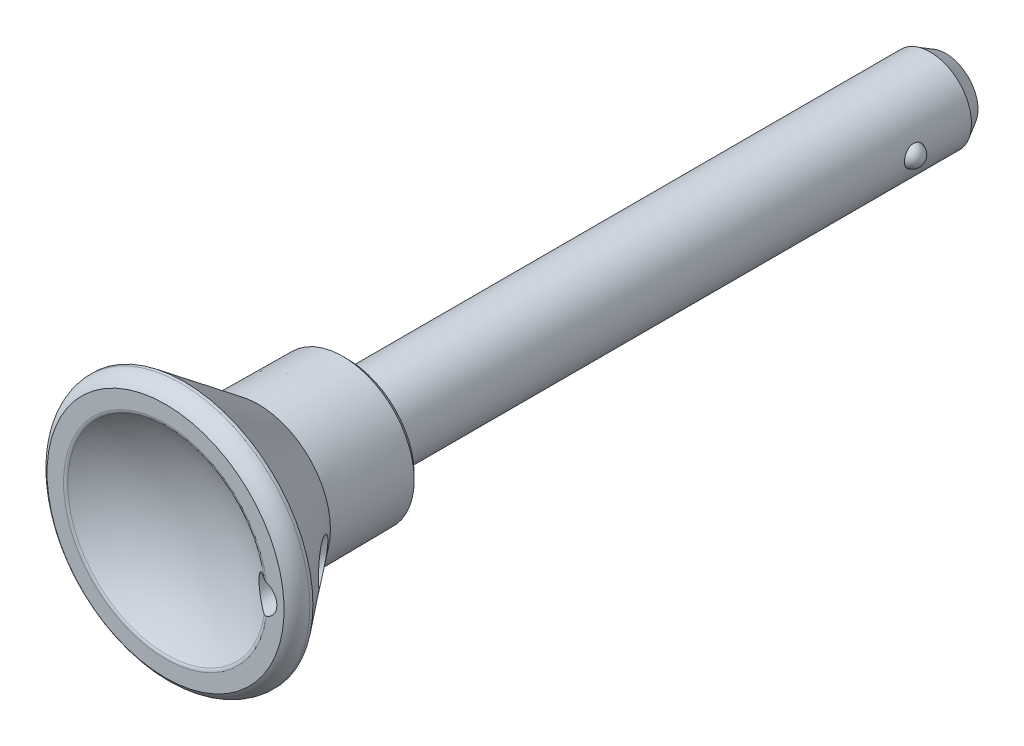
ISO-10303-21;
HEADER;
FILE_DESCRIPTION(('STEP AP214'),'2;1');
FILE_NAME('part.step','',(''),(''),'','','');
FILE_SCHEMA(('AUTOMOTIVE_DESIGN { 1 0 10303 214 1 1 1 1 }'));
ENDSEC;
DATA;
#1=APPLICATION_CONTEXT('core data for automotive mechanical design processes');
#2=APPLICATION_PROTOCOL_DEFINITION('international standard','automotive_design',2000,#1);
#3=PRODUCT_CONTEXT('',#1,'mechanical');
#4=PRODUCT('Part','Part','',(#3));
#5=PRODUCT_RELATED_PRODUCT_CATEGORY('part','',(#4));
#6=PRODUCT_DEFINITION_FORMATION('','',#4);
#7=PRODUCT_DEFINITION_CONTEXT('part definition',#1,'design');
#8=PRODUCT_DEFINITION('design','',#6,#7);
#9=PRODUCT_DEFINITION_SHAPE('','',#8);
#10=(LENGTH_UNIT() NAMED_UNIT(*) SI_UNIT(.MILLI.,.METRE.));
#11=(NAMED_UNIT(*) PLANE_ANGLE_UNIT() SI_UNIT($,.RADIAN.));
#12=(NAMED_UNIT(*) SI_UNIT($,.STERADIAN.) SOLID_ANGLE_UNIT());
#13=UNCERTAINTY_MEASURE_WITH_UNIT(LENGTH_MEASURE(1.E-05),#10,'distance_accuracy_value','');
#14=(GEOMETRIC_REPRESENTATION_CONTEXT(3) GLOBAL_UNCERTAINTY_ASSIGNED_CONTEXT((#13)) GLOBAL_UNIT_ASSIGNED_CONTEXT((#10,
#11,#12)) REPRESENTATION_CONTEXT('',''));
#15=CARTESIAN_POINT('',(0.,0.,0.));
#16=DIRECTION('',(0.,0.,1.));
#17=DIRECTION('',(1.,0.,0.));
#18=AXIS2_PLACEMENT_3D('',#15,#16,#17);
#19=CARTESIAN_POINT('',(0.,0.,0.));
#20=DIRECTION('',(0.,0.,1.));
#21=DIRECTION('',(0.,-1.,0.));
#22=AXIS2_PLACEMENT_3D('',#19,#20,#21);
#23=CYLINDRICAL_SURFACE('',#22,4.);
#24=CARTESIAN_POINT('',(0.,0.,0.));
#25=DIRECTION('',(0.,0.,1.));
#26=DIRECTION('',(0.,-1.,0.));
#27=AXIS2_PLACEMENT_3D('',#24,#25,#26);
#28=CIRCLE('',#27,4.);
#29=CARTESIAN_POINT('',(0.,-4.,0.));
#30=VERTEX_POINT('',#29);
#31=EDGE_CURVE('E17',#30,#30,#28,.T.);
#32=ORIENTED_EDGE('',*,*,#31,.F.);
#33=EDGE_LOOP('',(#32));
#34=FACE_BOUND('',#33,.T.);
#35=CARTESIAN_POINT('',(3.88177455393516,0.96531151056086,-50.7388991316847));
#36=CARTESIAN_POINT('',(3.87947589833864,0.974537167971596,-50.7717537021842));
#37=CARTESIAN_POINT('',(3.87758596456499,0.982015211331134,-50.805105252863));
#38=CARTESIAN_POINT('',(3.87470673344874,0.993322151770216,-50.8719408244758));
#39=CARTESIAN_POINT('',(3.8737042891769,0.997204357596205,-50.9054152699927));
#40=CARTESIAN_POINT('',(3.87228725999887,1.00270077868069,-50.9925132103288));
#41=CARTESIAN_POINT('',(3.87257020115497,1.0016187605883,-51.0463531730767));
#42=CARTESIAN_POINT('',(3.87471439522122,0.993273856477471,-51.1269570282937));
#43=CARTESIAN_POINT('',(3.87573945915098,0.989279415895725,-51.1541316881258));
#44=CARTESIAN_POINT('',(3.87834788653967,0.97900141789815,-51.2080101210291));
#45=CARTESIAN_POINT('',(3.87993110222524,0.972718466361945,-51.2347140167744));
#46=CARTESIAN_POINT('',(3.88177455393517,0.965311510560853,-51.2611008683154));
#47=B_SPLINE_CURVE_WITH_KNOTS('',3,(#35,#36,#37,#38,#39,#40,#41,#42,#43,#44,#45,#46),
.UNSPECIFIED.,.F.,.F.,(4,2,2,2,2,4),(0.,0.102513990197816,0.20348266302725,0.364121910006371,
0.446491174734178,0.528838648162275),.UNSPECIFIED.);
#48=CARTESIAN_POINT('',(3.88177451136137,0.965311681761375,-50.7388997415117));
#49=VERTEX_POINT('',#48);
#50=CARTESIAN_POINT('',(3.88177446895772,0.965311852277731,-51.2610996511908));
#51=VERTEX_POINT('',#50);
#52=EDGE_CURVE('E60',#49,#51,#47,.T.);
#53=ORIENTED_EDGE('',*,*,#52,.T.);
#54=CARTESIAN_POINT('',(3.88177448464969,0.965311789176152,-51.2610998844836));
#55=CARTESIAN_POINT('',(3.88540385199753,0.950638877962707,-51.3155094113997));
#56=CARTESIAN_POINT('',(3.89014046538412,0.931319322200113,-51.3685420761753));
#57=CARTESIAN_POINT('',(3.90112983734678,0.884199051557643,-51.4704413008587));
#58=CARTESIAN_POINT('',(3.90738045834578,0.856410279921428,-51.5193136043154));
#59=CARTESIAN_POINT('',(3.92071189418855,0.793126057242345,-51.6116284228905));
#60=CARTESIAN_POINT('',(3.92779250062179,0.757632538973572,-51.6550722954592));
#61=CARTESIAN_POINT('',(3.94199278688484,0.679892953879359,-51.7354385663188));
#62=CARTESIAN_POINT('',(3.94911247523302,0.637645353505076,-51.7723594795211));
#63=CARTESIAN_POINT('',(3.96270366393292,0.546907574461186,-51.8391103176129));
#64=CARTESIAN_POINT('',(3.96916547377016,0.498343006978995,-51.8688412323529));
#65=CARTESIAN_POINT('',(3.9806028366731,0.396745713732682,-51.9196822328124));
#66=CARTESIAN_POINT('',(3.98557913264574,0.343715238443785,-51.9407966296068));
#67=CARTESIAN_POINT('',(3.99291972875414,0.242471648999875,-51.9713879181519));
#68=CARTESIAN_POINT('',(3.99555479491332,0.194645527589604,-51.9820925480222));
#69=CARTESIAN_POINT('',(3.99909511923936,0.0978826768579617,-51.9963986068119));
#70=CARTESIAN_POINT('',(4.00000061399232,0.0489461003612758,-52.0000010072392));
#71=CARTESIAN_POINT('',(3.99999930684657,-0.0552566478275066,-51.999998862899));
#72=CARTESIAN_POINT('',(3.99884379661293,-0.110525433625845,-51.9954052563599));
#73=CARTESIAN_POINT('',(3.99434700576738,-0.219475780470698,-51.9771816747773));
#74=CARTESIAN_POINT('',(3.9910047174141,-0.273156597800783,-51.9635475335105));
#75=CARTESIAN_POINT('',(3.98250420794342,-0.377347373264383,-51.9277072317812));
#76=CARTESIAN_POINT('',(3.97734807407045,-0.427860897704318,-51.9055109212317));
#77=CARTESIAN_POINT('',(3.96576893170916,-0.524447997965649,-51.8532124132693));
#78=CARTESIAN_POINT('',(3.95934587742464,-0.570521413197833,-51.8231099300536));
#79=CARTESIAN_POINT('',(3.94578204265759,-0.657873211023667,-51.7551953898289));
#80=CARTESIAN_POINT('',(3.93863012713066,-0.699046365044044,-51.7172502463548));
#81=CARTESIAN_POINT('',(3.92448848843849,-0.774509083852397,-51.6350198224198));
#82=CARTESIAN_POINT('',(3.91749874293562,-0.808799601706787,-51.5907354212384));
#83=CARTESIAN_POINT('',(3.90495270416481,-0.867284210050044,-51.5004846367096));
#84=CARTESIAN_POINT('',(3.8993282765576,-0.892041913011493,-51.4548922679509));
#85=CARTESIAN_POINT('',(3.88941506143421,-0.934286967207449,-51.3602904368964));
#86=CARTESIAN_POINT('',(3.88512710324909,-0.951769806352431,-51.3112788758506));
#87=CARTESIAN_POINT('',(3.88177448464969,-0.965311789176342,-51.2610998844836));
#88=B_SPLINE_CURVE_WITH_KNOTS('',3,(#54,#55,#56,#57,#58,#59,#60,#61,#62,#63,#64,#65,#66,#67,#68,
#69,#70,#71,#72,#73,#74,#75,#76,#77,#78,#79,#80,#81,#82,#83,#84,#85,#86,#87),.UNSPECIFIED.,.F.,
.F.,(4,2,2,2,2,2,2,2,2,2,2,2,2,2,2,2,4),(0.,0.169132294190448,0.338027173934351,
0.506879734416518,0.675770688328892,0.846869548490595,1.01788269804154,1.16458276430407,
1.31126276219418,1.47685399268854,1.64252158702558,1.80799916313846,1.97348272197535,
2.14204685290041,2.31058762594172,2.46651284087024,2.62253462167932),.UNSPECIFIED.);
#89=CARTESIAN_POINT('',(3.88177451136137,-0.965311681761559,-51.2611002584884));
#90=VERTEX_POINT('',#89);
#91=EDGE_CURVE('E72',#51,#90,#88,.T.);
#92=ORIENTED_EDGE('',*,*,#91,.T.);
#93=CARTESIAN_POINT('',(3.88177455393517,-0.965311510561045,-51.2611008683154));
#94=CARTESIAN_POINT('',(3.87947589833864,-0.974537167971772,-51.2282462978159));
#95=CARTESIAN_POINT('',(3.87758596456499,-0.982015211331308,-51.1948947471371));
#96=CARTESIAN_POINT('',(3.87470673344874,-0.993322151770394,-51.1280591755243));
#97=CARTESIAN_POINT('',(3.8737042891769,-0.997204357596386,-51.0945847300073));
#98=CARTESIAN_POINT('',(3.87228725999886,-1.00270077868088,-51.0074867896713));
#99=CARTESIAN_POINT('',(3.87257020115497,-1.00161876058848,-50.9536468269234));
#100=CARTESIAN_POINT('',(3.87471439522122,-0.993273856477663,-50.8730429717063));
#101=CARTESIAN_POINT('',(3.87573945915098,-0.989279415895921,-50.8458683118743));
#102=CARTESIAN_POINT('',(3.87834788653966,-0.979001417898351,-50.791989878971));
#103=CARTESIAN_POINT('',(3.87993110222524,-0.972718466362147,-50.7652859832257));
#104=CARTESIAN_POINT('',(3.88177455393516,-0.965311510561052,-50.7388991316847));
#105=B_SPLINE_CURVE_WITH_KNOTS('',3,(#93,#94,#95,#96,#97,#98,#99,#100,#101,#102,#103,#104),
.UNSPECIFIED.,.F.,.F.,(4,2,2,2,2,4),(0.,0.102513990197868,0.203482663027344,0.36412191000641,
0.446491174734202,0.528838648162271),.UNSPECIFIED.);
#106=CARTESIAN_POINT('',(3.88177446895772,-0.965311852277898,-50.7389003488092));
#107=VERTEX_POINT('',#106);
#108=EDGE_CURVE('E57',#90,#107,#105,.T.);
#109=ORIENTED_EDGE('',*,*,#108,.T.);
#110=CARTESIAN_POINT('',(3.88177448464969,-0.965311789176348,-50.7389001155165));
#111=CARTESIAN_POINT('',(3.88540385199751,-0.950638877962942,-50.6844905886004));
#112=CARTESIAN_POINT('',(3.89014046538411,-0.931319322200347,-50.6314579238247));
#113=CARTESIAN_POINT('',(3.90112983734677,-0.884199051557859,-50.5295586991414));
#114=CARTESIAN_POINT('',(3.90738045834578,-0.85641027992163,-50.4806863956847));
#115=CARTESIAN_POINT('',(3.92071189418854,-0.793126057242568,-50.3883715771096));
#116=CARTESIAN_POINT('',(3.92779250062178,-0.75763253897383,-50.3449277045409));
#117=CARTESIAN_POINT('',(3.94199278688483,-0.679892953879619,-50.2645614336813));
#118=CARTESIAN_POINT('',(3.94911247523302,-0.637645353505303,-50.227640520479));
#119=CARTESIAN_POINT('',(3.96270366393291,-0.546907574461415,-50.1608896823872));
#120=CARTESIAN_POINT('',(3.96916547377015,-0.498343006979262,-50.1311587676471));
#121=CARTESIAN_POINT('',(3.98060283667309,-0.396745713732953,-50.0803177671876));
#122=CARTESIAN_POINT('',(3.98557913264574,-0.343715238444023,-50.0592033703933));
#123=CARTESIAN_POINT('',(3.99291972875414,-0.242471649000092,-50.0286120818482));
#124=CARTESIAN_POINT('',(3.99555479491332,-0.194645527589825,-50.0179074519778));
#125=CARTESIAN_POINT('',(3.99909511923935,-0.0978826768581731,-50.0036013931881));
#126=CARTESIAN_POINT('',(4.00000061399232,-0.048946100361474,-49.9999989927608));
#127=CARTESIAN_POINT('',(3.99999930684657,0.0552566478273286,-50.000001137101));
#128=CARTESIAN_POINT('',(3.99884379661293,0.110525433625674,-50.0045947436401));
#129=CARTESIAN_POINT('',(3.99434700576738,0.219475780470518,-50.0228183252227));
#130=CARTESIAN_POINT('',(3.9910047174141,0.273156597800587,-50.0364524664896));
#131=CARTESIAN_POINT('',(3.98250420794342,0.37734737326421,-50.0722927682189));
#132=CARTESIAN_POINT('',(3.97734807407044,0.427860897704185,-50.0944890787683));
#133=CARTESIAN_POINT('',(3.96576893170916,0.52444799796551,-50.1467875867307));
#134=CARTESIAN_POINT('',(3.95934587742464,0.570521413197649,-50.1768900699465));
#135=CARTESIAN_POINT('',(3.94578204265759,0.657873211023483,-50.2448046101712));
#136=CARTESIAN_POINT('',(3.93863012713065,0.699046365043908,-50.2827497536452));
#137=CARTESIAN_POINT('',(3.92448848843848,0.774509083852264,-50.3649801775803));
#138=CARTESIAN_POINT('',(3.91749874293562,0.80879960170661,-50.4092645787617));
#139=CARTESIAN_POINT('',(3.90495270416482,0.867284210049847,-50.4995153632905));
#140=CARTESIAN_POINT('',(3.8993282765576,0.892041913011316,-50.5451077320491));
#141=CARTESIAN_POINT('',(3.8894150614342,0.9342869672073,-50.6397095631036));
#142=CARTESIAN_POINT('',(3.88512710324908,0.951769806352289,-50.6887211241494));
#143=CARTESIAN_POINT('',(3.88177448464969,0.965311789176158,-50.7389001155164));
#144=B_SPLINE_CURVE_WITH_KNOTS('',3,(#110,#111,#112,#113,#114,#115,#116,#117,#118,#119,#120,
#121,#122,#123,#124,#125,#126,#127,#128,#129,#130,#131,#132,#133,#134,#135,#136,#137,#138,#139,
#140,#141,#142,#143),.UNSPECIFIED.,.F.,.F.,(4,2,2,2,2,2,2,2,2,2,2,2,2,2,2,2,4),(0.,
0.169132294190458,0.338027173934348,0.506879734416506,0.675770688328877,0.846869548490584,
1.01788269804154,1.16458276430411,1.31126276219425,1.47685399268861,1.64252158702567,
1.80799916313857,1.97348272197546,2.14204685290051,2.31058762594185,2.46651284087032,
2.62253462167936),.UNSPECIFIED.);
#145=EDGE_CURVE('E66',#107,#49,#144,.T.);
#146=ORIENTED_EDGE('',*,*,#145,.T.);
#147=EDGE_LOOP('',(#53,#92,#109,#146));
#148=FACE_BOUND('',#147,.T.);
#149=CARTESIAN_POINT('',(0.,0.,-56.5));
#150=DIRECTION('',(0.,0.,1.));
#151=DIRECTION('',(1.,0.,0.));
#152=AXIS2_PLACEMENT_3D('',#149,#150,#151);
#153=CIRCLE('',#152,4.);
#154=CARTESIAN_POINT('',(4.,0.,-56.5));
#155=VERTEX_POINT('',#154);
#156=EDGE_CURVE('E69',#155,#155,#153,.T.);
#157=ORIENTED_EDGE('',*,*,#156,.T.);
#158=EDGE_LOOP('',(#157));
#159=FACE_BOUND('',#158,.T.);
#160=ADVANCED_FACE('F14',(#34,#148,#159),#23,.T.);
#161=CARTESIAN_POINT('',(6.4240762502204,-6.50116727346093,0.));
#162=DIRECTION('',(0.,0.,-1.));
#163=DIRECTION('',(-1.,0.,0.));
#164=AXIS2_PLACEMENT_3D('',#161,#162,#163);
#165=PLANE('',#164);
#166=ORIENTED_EDGE('',*,*,#31,.T.);
#167=EDGE_LOOP('',(#166));
#168=FACE_BOUND('',#167,.T.);
#169=CARTESIAN_POINT('',(0.,0.,0.));
#170=DIRECTION('',(0.,0.,1.));
#171=DIRECTION('',(0.,-1.,0.));
#172=AXIS2_PLACEMENT_3D('',#169,#170,#171);
#173=CIRCLE('',#172,6.4240762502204);
#174=CARTESIAN_POINT('',(0.,-6.4240762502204,0.));
#175=VERTEX_POINT('',#174);
#176=EDGE_CURVE('E183',#175,#175,#173,.T.);
#177=ORIENTED_EDGE('',*,*,#176,.F.);
#178=EDGE_LOOP('',(#177));
#179=FACE_BOUND('',#178,.T.);
#180=ADVANCED_FACE('F241',(#168,#179),#165,.T.);
#181=CARTESIAN_POINT('',(0.,0.,0.));
#182=DIRECTION('',(0.,0.,1.));
#183=DIRECTION('',(0.,-1.,0.));
#184=AXIS2_PLACEMENT_3D('',#181,#182,#183);
#185=CONICAL_SURFACE('',#184,6.4240762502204,0.789761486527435);
#186=CARTESIAN_POINT('',(0.,0.,0.499980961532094));
#187=DIRECTION('',(0.,0.,-1.));
#188=DIRECTION('',(1.,0.,0.));
#189=AXIS2_PLACEMENT_3D('',#186,#187,#188);
#190=CIRCLE('',#189,6.92843951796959);
#191=CARTESIAN_POINT('',(6.92843951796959,0.,0.499980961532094));
#192=VERTEX_POINT('',#191);
#193=EDGE_CURVE('E179',#192,#192,#190,.F.);
#194=ORIENTED_EDGE('',*,*,#193,.F.);
#195=EDGE_LOOP('',(#194));
#196=FACE_BOUND('',#195,.T.);
#197=ORIENTED_EDGE('',*,*,#176,.T.);
#198=EDGE_LOOP('',(#197));
#199=FACE_BOUND('',#198,.T.);
#200=ADVANCED_FACE('F233',(#196,#199),#185,.T.);
#201=CARTESIAN_POINT('',(0.,0.,0.499980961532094));
#202=DIRECTION('',(0.,0.,1.));
#203=DIRECTION('',(0.,-1.,0.));
#204=AXIS2_PLACEMENT_3D('',#201,#202,#203);
#205=CONICAL_SURFACE('',#204,6.92843951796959,0.00872664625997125);
#206=CARTESIAN_POINT('',(0.,0.,8.7));
#207=DIRECTION('',(0.,0.,-1.));
#208=DIRECTION('',(1.,0.,0.));
#209=AXIS2_PLACEMENT_3D('',#206,#207,#208);
#210=CIRCLE('',#209,7.);
#211=CARTESIAN_POINT('',(7.,0.,8.7));
#212=VERTEX_POINT('',#211);
#213=EDGE_CURVE('E175',#212,#212,#210,.F.);
#214=ORIENTED_EDGE('',*,*,#213,.F.);
#215=EDGE_LOOP('',(#214));
#216=FACE_BOUND('',#215,.T.);
#217=ORIENTED_EDGE('',*,*,#193,.T.);
#218=EDGE_LOOP('',(#217));
#219=FACE_BOUND('',#218,.T.);
#220=ADVANCED_FACE('F226',(#216,#219),#205,.T.);
#221=CARTESIAN_POINT('',(0.,0.,16.2));
#222=DIRECTION('',(0.,0.,1.));
#223=DIRECTION('',(0.,-1.,0.));
#224=AXIS2_PLACEMENT_3D('',#221,#222,#223);
#225=CYLINDRICAL_SURFACE('',#224,12.5);
#226=CARTESIAN_POINT('',(0.,0.,15.9));
#227=DIRECTION('',(0.,0.,-1.));
#228=DIRECTION('',(1.,0.,0.));
#229=AXIS2_PLACEMENT_3D('',#226,#227,#228);
#230=CIRCLE('',#229,12.5);
#231=CARTESIAN_POINT('',(12.5,0.,15.9));
#232=VERTEX_POINT('',#231);
#233=EDGE_CURVE('E176',#232,#232,#230,.T.);
#234=ORIENTED_EDGE('',*,*,#233,.F.);
#235=EDGE_LOOP('',(#234));
#236=FACE_BOUND('',#235,.T.);
#237=CARTESIAN_POINT('',(0.,0.,16.2));
#238=DIRECTION('',(0.,0.,1.));
#239=DIRECTION('',(0.,-1.,0.));
#240=AXIS2_PLACEMENT_3D('',#237,#238,#239);
#241=CIRCLE('',#240,12.5);
#242=CARTESIAN_POINT('',(0.,-12.5,16.2));
#243=VERTEX_POINT('',#242);
#244=EDGE_CURVE('E172',#243,#243,#241,.T.);
#245=ORIENTED_EDGE('',*,*,#244,.F.);
#246=EDGE_LOOP('',(#245));
#247=FACE_BOUND('',#246,.T.);
#248=ADVANCED_FACE('F219',(#236,#247),#225,.T.);
#249=CARTESIAN_POINT('',(0.,0.,8.7));
#250=DIRECTION('',(0.,0.,1.));
#251=DIRECTION('',(0.,-1.,0.));
#252=AXIS2_PLACEMENT_3D('',#249,#250,#251);
#253=CONICAL_SURFACE('',#252,7.,0.65233090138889);
#254=CARTESIAN_POINT('',(9.05806451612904,-1.48036050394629,11.5515077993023));
#255=CARTESIAN_POINT('',(8.99141512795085,-1.46946825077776,11.4631001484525));
#256=CARTESIAN_POINT('',(8.92550148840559,-1.45408557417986,11.3746905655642));
#257=CARTESIAN_POINT('',(8.7955636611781,-1.41427171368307,11.1984472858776));
#258=CARTESIAN_POINT('',(8.73154031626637,-1.38983655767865,11.1106138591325));
#259=CARTESIAN_POINT('',(8.60623315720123,-1.33170423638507,10.936758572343));
#260=CARTESIAN_POINT('',(8.54493725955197,-1.29805393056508,10.8507298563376));
#261=CARTESIAN_POINT('',(8.42544336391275,-1.22074353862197,10.6811358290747));
#262=CARTESIAN_POINT('',(8.36724184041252,-1.17709515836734,10.5975677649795));
#263=CARTESIAN_POINT('',(8.26922940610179,-1.09114708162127,10.4552980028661));
#264=CARTESIAN_POINT('',(8.22852162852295,-1.05135683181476,10.3957022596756));
#265=CARTESIAN_POINT('',(8.14989980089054,-0.964725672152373,10.2796936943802));
#266=CARTESIAN_POINT('',(8.11198828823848,-0.917878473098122,10.2232837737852));
#267=CARTESIAN_POINT('',(8.03963417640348,-0.81574430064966,10.1148327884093));
#268=CARTESIAN_POINT('',(8.00522654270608,-0.760383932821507,10.0628364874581));
#269=CARTESIAN_POINT('',(7.94192848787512,-0.640477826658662,9.96655825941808));
#270=CARTESIAN_POINT('',(7.91302454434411,-0.575955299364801,9.92225744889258));
#271=CARTESIAN_POINT('',(7.87251252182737,-0.463057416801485,9.85986137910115));
#272=CARTESIAN_POINT('',(7.85846623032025,-0.417573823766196,9.8381417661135));
#273=CARTESIAN_POINT('',(7.83441768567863,-0.323152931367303,9.80086955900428));
#274=CARTESIAN_POINT('',(7.82440740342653,-0.274222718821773,9.78530472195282));
#275=CARTESIAN_POINT('',(7.81132335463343,-0.18762068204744,9.76493500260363));
#276=CARTESIAN_POINT('',(7.80710048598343,-0.15053785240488,9.7583503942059));
#277=CARTESIAN_POINT('',(7.80143783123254,-0.0756412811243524,9.74951765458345));
#278=CARTESIAN_POINT('',(7.79999798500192,-0.0378275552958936,9.7472694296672));
#279=CARTESIAN_POINT('',(7.8000025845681,0.0485200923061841,9.74727695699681));
#280=CARTESIAN_POINT('',(7.80237736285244,0.0970629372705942,9.75098545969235));
#281=CARTESIAN_POINT('',(7.81164444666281,0.192651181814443,9.76543406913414));
#282=CARTESIAN_POINT('',(7.81854204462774,0.239694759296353,9.77618241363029));
#283=CARTESIAN_POINT('',(7.83829683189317,0.341610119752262,9.80688772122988));
#284=CARTESIAN_POINT('',(7.85215507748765,0.395817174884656,9.82838678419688));
#285=CARTESIAN_POINT('',(7.8845198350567,0.499375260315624,9.87838349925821));
#286=CARTESIAN_POINT('',(7.90303499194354,0.548717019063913,9.9068941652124));
#287=CARTESIAN_POINT('',(7.95423062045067,0.667068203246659,9.98533549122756));
#288=CARTESIAN_POINT('',(7.98924354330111,0.732796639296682,10.0386516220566));
#289=CARTESIAN_POINT('',(8.06472209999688,0.853932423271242,10.1525776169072));
#290=CARTESIAN_POINT('',(8.10520064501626,0.909314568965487,10.2132047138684));
#291=CARTESIAN_POINT('',(8.18383548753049,1.00367842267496,10.3298982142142));
#292=CARTESIAN_POINT('',(8.22147534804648,1.04387385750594,10.3853483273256));
#293=CARTESIAN_POINT('',(8.29898008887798,1.1184153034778,10.4986148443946));
#294=CARTESIAN_POINT('',(8.33884646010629,1.15275733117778,10.556432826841));
#295=CARTESIAN_POINT('',(8.42042546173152,1.21614962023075,10.6737908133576));
#296=CARTESIAN_POINT('',(8.46214099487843,1.24519116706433,10.7333334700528));
#297=CARTESIAN_POINT('',(8.54706483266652,1.29830522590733,10.8535675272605));
#298=CARTESIAN_POINT('',(8.59027353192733,1.32237641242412,10.9142592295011));
#299=CARTESIAN_POINT('',(8.69675324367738,1.37513054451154,11.0626135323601));
#300=CARTESIAN_POINT('',(8.7606819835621,1.40136483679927,11.150681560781));
#301=CARTESIAN_POINT('',(8.89058399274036,1.44466814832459,11.3275915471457));
#302=CARTESIAN_POINT('',(8.95655819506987,1.46173291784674,11.4164338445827));
#303=CARTESIAN_POINT('',(9.09008194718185,1.48679092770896,11.5942301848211));
#304=CARTESIAN_POINT('',(9.15763151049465,1.49478409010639,11.683184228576));
#305=CARTESIAN_POINT('',(9.293788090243,1.50153429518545,11.8605390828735));
#306=CARTESIAN_POINT('',(9.36239469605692,1.50029483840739,11.9489400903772));
#307=CARTESIAN_POINT('',(9.53896432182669,1.48478544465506,12.1740527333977));
#308=CARTESIAN_POINT('',(9.64741582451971,1.46359594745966,12.3100469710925));
#309=CARTESIAN_POINT('',(9.80896256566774,1.41213790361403,12.5095339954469));
#310=CARTESIAN_POINT('',(9.86259038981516,1.39172486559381,12.5752398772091));
#311=CARTESIAN_POINT('',(9.96902195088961,1.34380635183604,12.7046889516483));
#312=CARTESIAN_POINT('',(10.021826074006,1.31630431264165,12.7684330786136));
#313=CARTESIAN_POINT('',(10.1398540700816,1.24522266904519,12.9099256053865));
#314=CARTESIAN_POINT('',(10.2046458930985,1.1993124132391,12.9868895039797));
#315=CARTESIAN_POINT('',(10.3299573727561,1.09357010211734,13.1345591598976));
#316=CARTESIAN_POINT('',(10.3904821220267,1.03375502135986,13.2052724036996));
#317=CARTESIAN_POINT('',(10.4895745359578,0.916081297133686,13.3202576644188));
#318=CARTESIAN_POINT('',(10.5297805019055,0.861692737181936,13.3666468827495));
#319=CARTESIAN_POINT('',(10.6043536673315,0.743973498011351,13.452316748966));
#320=CARTESIAN_POINT('',(10.6387288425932,0.68065525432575,13.4916071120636));
#321=CARTESIAN_POINT('',(10.6925693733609,0.560424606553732,13.5529446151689));
#322=CARTESIAN_POINT('',(10.7136506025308,0.505208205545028,13.5768833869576));
#323=CARTESIAN_POINT('',(10.7495749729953,0.390302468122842,13.6176027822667));
#324=CARTESIAN_POINT('',(10.7644289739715,0.330621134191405,13.6343958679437));
#325=CARTESIAN_POINT('',(10.7836092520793,0.22559659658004,13.6560593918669));
#326=CARTESIAN_POINT('',(10.7897268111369,0.180990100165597,13.6629607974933));
#327=CARTESIAN_POINT('',(10.7979243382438,0.0909301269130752,13.6722061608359));
#328=CARTESIAN_POINT('',(10.8000037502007,0.0454765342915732,13.6745494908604));
#329=CARTESIAN_POINT('',(10.799994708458,-0.0641674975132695,13.6745397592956));
#330=CARTESIAN_POINT('',(10.795841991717,-0.128380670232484,13.6698606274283));
#331=CARTESIAN_POINT('',(10.7796239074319,-0.254506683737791,13.6515601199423));
#332=CARTESIAN_POINT('',(10.7675483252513,-0.316416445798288,13.6379272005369));
#333=CARTESIAN_POINT('',(10.7366563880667,-0.435644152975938,13.6029693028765));
#334=CARTESIAN_POINT('',(10.7178919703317,-0.49299342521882,13.5817035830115));
#335=CARTESIAN_POINT('',(10.6748799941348,-0.602645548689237,13.532811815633));
#336=CARTESIAN_POINT('',(10.6506301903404,-0.654946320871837,13.5051831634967));
#337=CARTESIAN_POINT('',(10.5859735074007,-0.77647271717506,13.4312530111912));
#338=CARTESIAN_POINT('',(10.5432056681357,-0.842728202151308,13.3821425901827));
#339=CARTESIAN_POINT('',(10.4516580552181,-0.964099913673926,13.2763616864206));
#340=CARTESIAN_POINT('',(10.4028645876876,-1.01918998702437,13.2196739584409));
#341=CARTESIAN_POINT('',(10.2766029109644,-1.14345503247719,13.0719673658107));
#342=CARTESIAN_POINT('',(10.1967753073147,-1.20635475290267,12.9777102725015));
#343=CARTESIAN_POINT('',(10.0329696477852,-1.31236147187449,12.7820645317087));
#344=CARTESIAN_POINT('',(9.94898466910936,-1.35543413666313,12.6806638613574));
#345=CARTESIAN_POINT('',(9.79718248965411,-1.41705079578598,12.4951419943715));
#346=CARTESIAN_POINT('',(9.72964852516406,-1.43883766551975,12.4118303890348));
#347=CARTESIAN_POINT('',(9.59439459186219,-1.47247845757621,12.2433068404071));
#348=CARTESIAN_POINT('',(9.52667453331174,-1.48432617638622,12.1580937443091));
#349=CARTESIAN_POINT('',(9.39151350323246,-1.49875216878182,11.9862568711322));
#350=CARTESIAN_POINT('',(9.32407407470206,-1.50130123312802,11.8996295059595));
#351=CARTESIAN_POINT('',(9.19020636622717,-1.49747387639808,11.725837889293));
#352=CARTESIAN_POINT('',(9.12377782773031,-1.49109977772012,11.6386737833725));
#353=CARTESIAN_POINT('',(9.05806451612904,-1.48036050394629,11.5515077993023));
#354=B_SPLINE_CURVE_WITH_KNOTS('',3,(#254,#255,#256,#257,#258,#259,#260,#261,#262,#263,#264,
#265,#266,#267,#268,#269,#270,#271,#272,#273,#274,#275,#276,#277,#278,#279,#280,#281,#282,#283,
#284,#285,#286,#287,#288,#289,#290,#291,#292,#293,#294,#295,#296,#297,#298,#299,#300,#301,#302,
#303,#304,#305,#306,#307,#308,#309,#310,#311,#312,#313,#314,#315,#316,#317,#318,#319,#320,#321,
#322,#323,#324,#325,#326,#327,#328,#329,#330,#331,#332,#333,#334,#335,#336,#337,#338,#339,#340,
#341,#342,#343,#344,#345,#346,#347,#348,#349,#350,#351,#352,#353),.UNSPECIFIED.,.T.,.F.,(4,2,2,
2,2,2,2,2,2,2,2,2,2,2,2,2,2,2,2,2,2,2,2,2,2,2,2,2,2,2,2,2,2,2,2,2,2,2,2,2,2,2,2,2,2,2,2,2,2,4),
(0.,0.333658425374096,0.667463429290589,0.999601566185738,1.33135280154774,1.57826788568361,
1.82540433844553,2.07480511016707,2.32358497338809,2.48005639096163,2.63621497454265,
2.74958301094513,2.86294859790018,3.00835870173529,3.15393926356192,3.33275537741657,
3.51190592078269,3.78514778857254,4.05904679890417,4.2931693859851,4.52745067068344,
4.76211373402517,4.9968392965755,5.33221840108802,5.66775280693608,6.00329009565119,
6.33870017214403,6.86226215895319,7.12372139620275,7.38505412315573,7.71589293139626,
8.04632996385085,8.29159071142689,8.53651321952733,8.72709088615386,8.91733480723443,
9.05359735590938,9.18987866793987,9.38217192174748,9.57471358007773,9.76579164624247,
9.95694806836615,10.2340958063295,10.5118854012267,10.9254412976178,11.3397106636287,
11.6675345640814,11.995562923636,12.3246208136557,12.6535930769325),.UNSPECIFIED.);
#355=CARTESIAN_POINT('',(9.05806451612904,-1.48036050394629,11.5515077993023));
#356=VERTEX_POINT('',#355);
#357=EDGE_CURVE('E142',#356,#356,#354,.T.);
#358=ORIENTED_EDGE('',*,*,#357,.F.);
#359=EDGE_LOOP('',(#358));
#360=FACE_BOUND('',#359,.T.);
#361=ORIENTED_EDGE('',*,*,#233,.T.);
#362=EDGE_LOOP('',(#361));
#363=FACE_BOUND('',#362,.T.);
#364=ORIENTED_EDGE('',*,*,#213,.T.);
#365=EDGE_LOOP('',(#364));
#366=FACE_BOUND('',#365,.T.);
#367=ADVANCED_FACE('F165',(#360,#363,#366),#253,.T.);
#368=CARTESIAN_POINT('',(0.,0.,15.9596620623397));
#369=DIRECTION('',(0.,0.,1.));
#370=DIRECTION('',(0.,-1.,0.));
#371=AXIS2_PLACEMENT_3D('',#368,#369,#370);
#372=TOROIDAL_SURFACE('',#371,10.5144930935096,2.);
#373=ORIENTED_EDGE('',*,*,#244,.T.);
#374=EDGE_LOOP('',(#373));
#375=FACE_BOUND('',#374,.T.);
#376=CARTESIAN_POINT('',(0.,0.,17.7));
#377=DIRECTION('',(0.,0.,1.));
#378=DIRECTION('',(0.,-1.,0.));
#379=AXIS2_PLACEMENT_3D('',#376,#377,#378);
#380=CIRCLE('',#379,11.5);
#381=CARTESIAN_POINT('',(0.,-11.5,17.7));
#382=VERTEX_POINT('',#381);
#383=EDGE_CURVE('E187',#382,#382,#380,.T.);
#384=ORIENTED_EDGE('',*,*,#383,.F.);
#385=EDGE_LOOP('',(#384));
#386=FACE_BOUND('',#385,.T.);
#387=ADVANCED_FACE('F157',(#375,#386),#372,.T.);
#388=CARTESIAN_POINT('',(9.3,0.,9.7468824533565));
#389=DIRECTION('',(0.,0.,1.));
#390=DIRECTION('',(0.,-1.,0.));
#391=AXIS2_PLACEMENT_3D('',#388,#389,#390);
#392=CYLINDRICAL_SURFACE('',#391,1.5);
#393=ORIENTED_EDGE('',*,*,#357,.T.);
#394=EDGE_LOOP('',(#393));
#395=FACE_BOUND('',#394,.T.);
#396=CARTESIAN_POINT('',(9.79838709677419,-1.41478277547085,17.7));
#397=CARTESIAN_POINT('',(9.76967463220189,-1.42493393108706,17.7000278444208));
#398=CARTESIAN_POINT('',(9.74057958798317,-1.43416331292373,17.6978154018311));
#399=CARTESIAN_POINT('',(9.68339626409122,-1.45046247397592,17.688811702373));
#400=CARTESIAN_POINT('',(9.65530246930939,-1.45758512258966,17.6821493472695));
#401=CARTESIAN_POINT('',(9.60265119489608,-1.46937623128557,17.6649718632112));
#402=CARTESIAN_POINT('',(9.5780018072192,-1.47420693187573,17.6548534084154));
#403=CARTESIAN_POINT('',(9.52973678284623,-1.48251466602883,17.6305344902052));
#404=CARTESIAN_POINT('',(9.50616459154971,-1.48595330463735,17.6162348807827));
#405=CARTESIAN_POINT('',(9.48387096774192,-1.48868783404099,17.6));
#406=B_SPLINE_CURVE_WITH_KNOTS('',3,(#396,#397,#398,#399,#400,#401,#402,#403,#404,#405),
.UNSPECIFIED.,.F.,.F.,(4,2,2,2,4),(0.,0.0913475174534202,0.180157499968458,0.261045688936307,
0.344033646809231),.UNSPECIFIED.);
#407=CARTESIAN_POINT('',(9.79838709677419,-1.41478277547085,17.7));
#408=VERTEX_POINT('',#407);
#409=CARTESIAN_POINT('',(9.48387096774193,-1.48868783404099,17.6));
#410=VERTEX_POINT('',#409);
#411=EDGE_CURVE('E134',#408,#410,#406,.T.);
#412=ORIENTED_EDGE('',*,*,#411,.F.);
#413=CARTESIAN_POINT('',(9.3,0.,17.7));
#414=DIRECTION('',(0.,0.,1.));
#415=DIRECTION('',(0.,-1.,0.));
#416=AXIS2_PLACEMENT_3D('',#413,#414,#415);
#417=CIRCLE('',#416,1.5);
#418=CARTESIAN_POINT('',(9.79838709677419,1.41478277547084,17.7));
#419=VERTEX_POINT('',#418);
#420=EDGE_CURVE('E30',#419,#408,#417,.F.);
#421=ORIENTED_EDGE('',*,*,#420,.F.);
#422=CARTESIAN_POINT('',(9.79838709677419,1.41478277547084,17.7));
#423=CARTESIAN_POINT('',(9.76967463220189,1.42493393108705,17.7000278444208));
#424=CARTESIAN_POINT('',(9.74057958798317,1.43416331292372,17.6978154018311));
#425=CARTESIAN_POINT('',(9.68339626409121,1.45046247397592,17.688811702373));
#426=CARTESIAN_POINT('',(9.65530246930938,1.45758512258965,17.6821493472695));
#427=CARTESIAN_POINT('',(9.60265119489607,1.46937623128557,17.6649718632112));
#428=CARTESIAN_POINT('',(9.57800180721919,1.47420693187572,17.6548534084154));
#429=CARTESIAN_POINT('',(9.52973678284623,1.48251466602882,17.6305344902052));
#430=CARTESIAN_POINT('',(9.50616459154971,1.48595330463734,17.6162348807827));
#431=CARTESIAN_POINT('',(9.48387096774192,1.48868783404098,17.6));
#432=B_SPLINE_CURVE_WITH_KNOTS('',3,(#422,#423,#424,#425,#426,#427,#428,#429,#430,#431),
.UNSPECIFIED.,.F.,.F.,(4,2,2,2,4),(0.,0.0913475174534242,0.180157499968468,0.261045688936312,
0.344033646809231),.UNSPECIFIED.);
#433=CARTESIAN_POINT('',(9.48387096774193,1.48868783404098,17.6));
#434=VERTEX_POINT('',#433);
#435=EDGE_CURVE('E126',#419,#434,#432,.T.);
#436=ORIENTED_EDGE('',*,*,#435,.T.);
#437=CARTESIAN_POINT('',(9.48387096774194,-1.48868783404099,17.6));
#438=CARTESIAN_POINT('',(9.38181447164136,-1.5012604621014,17.5258231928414));
#439=CARTESIAN_POINT('',(9.27847034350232,-1.50339409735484,17.4514075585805));
#440=CARTESIAN_POINT('',(9.07150168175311,-1.48616897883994,17.3036113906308));
#441=CARTESIAN_POINT('',(8.96788247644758,-1.46662385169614,17.230245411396));
#442=CARTESIAN_POINT('',(8.76570217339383,-1.40554015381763,17.0882393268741));
#443=CARTESIAN_POINT('',(8.66709675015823,-1.36425592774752,17.0195547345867));
#444=CARTESIAN_POINT('',(8.47807170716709,-1.25938003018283,16.8888158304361));
#445=CARTESIAN_POINT('',(8.38761877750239,-1.19588484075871,16.8267343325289));
#446=CARTESIAN_POINT('',(8.24568836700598,-1.0697955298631,16.7298945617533));
#447=CARTESIAN_POINT('',(8.19079097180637,-1.01295594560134,16.692612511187));
#448=CARTESIAN_POINT('',(8.08925811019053,-0.889102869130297,16.6238983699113));
#449=CARTESIAN_POINT('',(8.04262373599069,-0.822088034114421,16.5924670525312));
#450=CARTESIAN_POINT('',(7.95961243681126,-0.678453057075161,16.5366671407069));
#451=CARTESIAN_POINT('',(7.9233211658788,-0.601759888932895,16.5123574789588));
#452=CARTESIAN_POINT('',(7.86387797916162,-0.441385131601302,16.4726071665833));
#453=CARTESIAN_POINT('',(7.84069382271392,-0.357721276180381,16.4571447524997));
#454=CARTESIAN_POINT('',(7.81665644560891,-0.227526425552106,16.4411240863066));
#455=CARTESIAN_POINT('',(7.81042627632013,-0.182354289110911,16.4369745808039));
#456=CARTESIAN_POINT('',(7.80209606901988,-0.0914654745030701,16.4314273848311));
#457=CARTESIAN_POINT('',(7.79999581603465,-0.0457488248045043,16.4300295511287));
#458=CARTESIAN_POINT('',(7.8000067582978,0.0738974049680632,16.4300365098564));
#459=CARTESIAN_POINT('',(7.80550430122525,0.147878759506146,16.4336949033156));
#460=CARTESIAN_POINT('',(7.82172596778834,0.257047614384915,16.4445026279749));
#461=CARTESIAN_POINT('',(7.82847272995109,0.293170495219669,16.4489987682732));
#462=CARTESIAN_POINT('',(7.84452794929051,0.36460984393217,16.4597055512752));
#463=CARTESIAN_POINT('',(7.85383787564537,0.399925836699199,16.4659171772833));
#464=CARTESIAN_POINT('',(7.88533418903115,0.503926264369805,16.4869492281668));
#465=CARTESIAN_POINT('',(7.91114789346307,0.571060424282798,16.5042071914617));
#466=CARTESIAN_POINT('',(7.97122958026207,0.699580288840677,16.5444764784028));
#467=CARTESIAN_POINT('',(8.00550445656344,0.760961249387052,16.5674924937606));
#468=CARTESIAN_POINT('',(8.06330229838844,0.849663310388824,16.6064232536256));
#469=CARTESIAN_POINT('',(8.08431449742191,0.879441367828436,16.6205962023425));
#470=CARTESIAN_POINT('',(8.12808579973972,0.936974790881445,16.6501700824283));
#471=CARTESIAN_POINT('',(8.15084283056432,0.964732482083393,16.6655695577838));
#472=CARTESIAN_POINT('',(8.22150377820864,1.04495101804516,16.7134720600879));
#473=CARTESIAN_POINT('',(8.27178709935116,1.09434151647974,16.7476721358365));
#474=CARTESIAN_POINT('',(8.38550726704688,1.19170689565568,16.8253434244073));
#475=CARTESIAN_POINT('',(8.44976642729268,1.2382209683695,16.8694253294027));
#476=CARTESIAN_POINT('',(8.58287694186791,1.31978473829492,16.961227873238));
#477=CARTESIAN_POINT('',(8.65173257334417,1.3548235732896,17.0089519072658));
#478=CARTESIAN_POINT('',(8.76337185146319,1.40144242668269,17.0867690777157));
#479=CARTESIAN_POINT('',(8.80522580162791,1.41674274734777,17.1160369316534));
#480=CARTESIAN_POINT('',(8.88962205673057,1.44344948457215,17.1752539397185));
#481=CARTESIAN_POINT('',(8.93216367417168,1.45485956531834,17.2052024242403));
#482=CARTESIAN_POINT('',(9.06048356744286,1.48334429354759,17.2958544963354));
#483=CARTESIAN_POINT('',(9.14699642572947,1.4946896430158,17.3573922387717));
#484=CARTESIAN_POINT('',(9.31725275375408,1.50223877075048,17.4793658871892));
#485=CARTESIAN_POINT('',(9.40099551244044,1.49891929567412,17.5397732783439));
#486=CARTESIAN_POINT('',(9.48387096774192,1.4886878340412,17.6));
#487=B_SPLINE_CURVE_WITH_KNOTS('',3,(#437,#438,#439,#440,#441,#442,#443,#444,#445,#446,#447,
#448,#449,#450,#451,#452,#453,#454,#455,#456,#457,#458,#459,#460,#461,#462,#463,#464,#465,#466,
#467,#468,#469,#470,#471,#472,#473,#474,#475,#476,#477,#478,#479,#480,#481,#482,#483,#484,#485,
#486),.UNSPECIFIED.,.F.,.F.,(4,2,2,2,2,2,2,2,2,2,2,2,2,2,2,2,2,2,2,2,2,2,2,2,4),(0.,
0.380173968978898,0.763641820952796,1.14271969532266,1.52017093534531,1.7812816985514,
2.04242694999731,2.30567583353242,2.5682743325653,2.70539664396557,2.84251181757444,
3.06399194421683,3.17494513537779,3.2859620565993,3.50680011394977,3.72781870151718,
3.8450322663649,3.96210870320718,4.19632161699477,4.4675973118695,4.73912905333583,
4.89893578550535,5.05859157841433,5.37775215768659,5.6866146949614),.UNSPECIFIED.);
#488=EDGE_CURVE('E141',#410,#434,#487,.T.);
#489=ORIENTED_EDGE('',*,*,#488,.F.);
#490=EDGE_LOOP('',(#412,#421,#436,#489));
#491=FACE_BOUND('',#490,.T.);
#492=ADVANCED_FACE('F152',(#395,#491),#392,.F.);
#493=CARTESIAN_POINT('',(0.,0.,30.4));
#494=DIRECTION('',(0.,-1.,0.));
#495=DIRECTION('',(0.,0.,1.));
#496=AXIS2_PLACEMENT_3D('',#493,#494,#495);
#497=SPHERICAL_SURFACE('',#496,16.);
#498=ORIENTED_EDGE('',*,*,#488,.T.);
#499=CARTESIAN_POINT('',(0.,0.,17.6));
#500=DIRECTION('',(0.,0.,1.));
#501=DIRECTION('',(0.,-1.,0.));
#502=AXIS2_PLACEMENT_3D('',#499,#500,#501);
#503=CIRCLE('',#502,9.6);
#504=EDGE_CURVE('E23',#410,#434,#503,.F.);
#505=ORIENTED_EDGE('',*,*,#504,.F.);
#506=EDGE_LOOP('',(#498,#505));
#507=FACE_BOUND('',#506,.T.);
#508=ADVANCED_FACE('F156',(#507),#497,.F.);
#509=CARTESIAN_POINT('',(-11.73,-11.4999999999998,17.7));
#510=CARTESIAN_POINT('',(-11.5,-11.4999999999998,17.7));
#511=CARTESIAN_POINT('',(11.5,-11.4999999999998,17.7));
#512=B_SPLINE_CURVE_WITH_KNOTS('',1,(#509,#510,#511),.UNSPECIFIED.,.F.,.F.,(2,1,2),(-0.01,0.,
1.),.UNSPECIFIED.);
#513=DIRECTION('',(0.,1.,0.));
#514=VECTOR('',#513,1.);
#515=SURFACE_OF_LINEAR_EXTRUSION('',#512,#514);
#516=ORIENTED_EDGE('',*,*,#420,.T.);
#517=CARTESIAN_POINT('',(0.,0.,17.7));
#518=DIRECTION('',(0.,0.,1.));
#519=DIRECTION('',(0.,-1.,0.));
#520=AXIS2_PLACEMENT_3D('',#517,#518,#519);
#521=CIRCLE('',#520,9.9);
#522=EDGE_CURVE('E9',#419,#408,#521,.T.);
#523=ORIENTED_EDGE('',*,*,#522,.F.);
#524=EDGE_LOOP('',(#516,#523));
#525=FACE_BOUND('',#524,.T.);
#526=ORIENTED_EDGE('',*,*,#383,.T.);
#527=EDGE_LOOP('',(#526));
#528=FACE_BOUND('',#527,.T.);
#529=ADVANCED_FACE('F121',(#525,#528),#515,.T.);
#530=CARTESIAN_POINT('',(0.,0.,17.2));
#531=DIRECTION('',(0.,0.,1.));
#532=DIRECTION('',(0.,-1.,0.));
#533=AXIS2_PLACEMENT_3D('',#530,#531,#532);
#534=TOROIDAL_SURFACE('',#533,9.89999999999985,0.50000000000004);
#535=ORIENTED_EDGE('',*,*,#435,.F.);
#536=ORIENTED_EDGE('',*,*,#522,.T.);
#537=ORIENTED_EDGE('',*,*,#411,.T.);
#538=ORIENTED_EDGE('',*,*,#504,.T.);
#539=EDGE_LOOP('',(#535,#536,#537,#538));
#540=FACE_BOUND('',#539,.T.);
#541=ADVANCED_FACE('F115',(#540),#534,.T.);
#542=CARTESIAN_POINT('',(3.13397459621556,-3.17158441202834,-58.));
#543=DIRECTION('',(0.,0.,-1.));
#544=DIRECTION('',(-1.,0.,0.));
#545=AXIS2_PLACEMENT_3D('',#542,#543,#544);
#546=PLANE('',#545);
#547=CARTESIAN_POINT('',(0.,0.,-58.));
#548=DIRECTION('',(0.,0.,1.));
#549=DIRECTION('',(0.,-1.,0.));
#550=AXIS2_PLACEMENT_3D('',#547,#548,#549);
#551=CIRCLE('',#550,3.13397459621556);
#552=CARTESIAN_POINT('',(0.,-3.13397459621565,-58.));
#553=VERTEX_POINT('',#552);
#554=EDGE_CURVE('E63',#553,#553,#551,.T.);
#555=ORIENTED_EDGE('',*,*,#554,.F.);
#556=EDGE_LOOP('',(#555));
#557=FACE_BOUND('',#556,.T.);
#558=ADVANCED_FACE('F120',(#557),#546,.T.);
#559=CARTESIAN_POINT('',(0.,0.,-58.));
#560=DIRECTION('',(0.,0.,1.));
#561=DIRECTION('',(0.,-1.,0.));
#562=AXIS2_PLACEMENT_3D('',#559,#560,#561);
#563=CONICAL_SURFACE('',#562,3.13397459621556,0.523598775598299);
#564=ORIENTED_EDGE('',*,*,#156,.F.);
#565=EDGE_LOOP('',(#564));
#566=FACE_BOUND('',#565,.T.);
#567=ORIENTED_EDGE('',*,*,#554,.T.);
#568=EDGE_LOOP('',(#567));
#569=FACE_BOUND('',#568,.T.);
#570=ADVANCED_FACE('F96',(#566,#569),#563,.T.);
#571=CARTESIAN_POINT('',(3.88177446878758,0.,-51.));
#572=DIRECTION('',(1.,0.,0.));
#573=DIRECTION('',(0.,-1.,0.));
#574=AXIS2_PLACEMENT_3D('',#571,#572,#573);
#575=CYLINDRICAL_SURFACE('',#574,1.);
#576=ORIENTED_EDGE('',*,*,#145,.F.);
#577=CARTESIAN_POINT('',(3.88177446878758,0.,-51.));
#578=DIRECTION('',(1.,0.,0.));
#579=DIRECTION('',(0.,-1.,0.));
#580=AXIS2_PLACEMENT_3D('',#577,#578,#579);
#581=CIRCLE('',#580,1.);
#582=EDGE_CURVE('E52',#107,#49,#581,.F.);
#583=ORIENTED_EDGE('',*,*,#582,.T.);
#584=EDGE_LOOP('',(#576,#583));
#585=FACE_BOUND('',#584,.T.);
#586=ADVANCED_FACE('F67',(#585),#575,.F.);
#587=CARTESIAN_POINT('',(3.88177446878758,0.,-51.));
#588=DIRECTION('',(1.,0.,0.));
#589=DIRECTION('',(0.,-1.,0.));
#590=AXIS2_PLACEMENT_3D('',#587,#588,#589);
#591=CYLINDRICAL_SURFACE('',#590,1.);
#592=CARTESIAN_POINT('',(3.88177446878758,0.,-51.));
#593=DIRECTION('',(1.,0.,0.));
#594=DIRECTION('',(0.,-1.,0.));
#595=AXIS2_PLACEMENT_3D('',#592,#593,#594);
#596=CIRCLE('',#595,1.);
#597=EDGE_CURVE('E64',#90,#51,#596,.T.);
#598=ORIENTED_EDGE('',*,*,#597,.F.);
#599=ORIENTED_EDGE('',*,*,#91,.F.);
#600=EDGE_LOOP('',(#598,#599));
#601=FACE_BOUND('',#600,.T.);
#602=ADVANCED_FACE('F344',(#601),#591,.F.);
#603=CARTESIAN_POINT('',(3.74,0.,-51.));
#604=DIRECTION('',(0.,-1.,0.));
#605=DIRECTION('',(0.,0.,-1.));
#606=AXIS2_PLACEMENT_3D('',#603,#604,#605);
#607=SPHERICAL_SURFACE('',#606,1.01);
#608=ORIENTED_EDGE('',*,*,#52,.F.);
#609=ORIENTED_EDGE('',*,*,#582,.F.);
#610=ORIENTED_EDGE('',*,*,#108,.F.);
#611=ORIENTED_EDGE('',*,*,#597,.T.);
#612=EDGE_LOOP('',(#608,#609,#610,#611));
#613=FACE_BOUND('',#612,.T.);
#614=ADVANCED_FACE('F54',(#613),#607,.T.);
#615=CLOSED_SHELL('',(#160,#180,#200,#220,#248,#367,#387,#492,#508,#529,#541,#558,#570,#586,
#602,#614));
#616=MANIFOLD_SOLID_BREP('B1',#615);
#617=ADVANCED_BREP_SHAPE_REPRESENTATION('',(#18,#616),#14);
#618=SHAPE_DEFINITION_REPRESENTATION(#9,#617);
ENDSEC;
END-ISO-10303-21;
